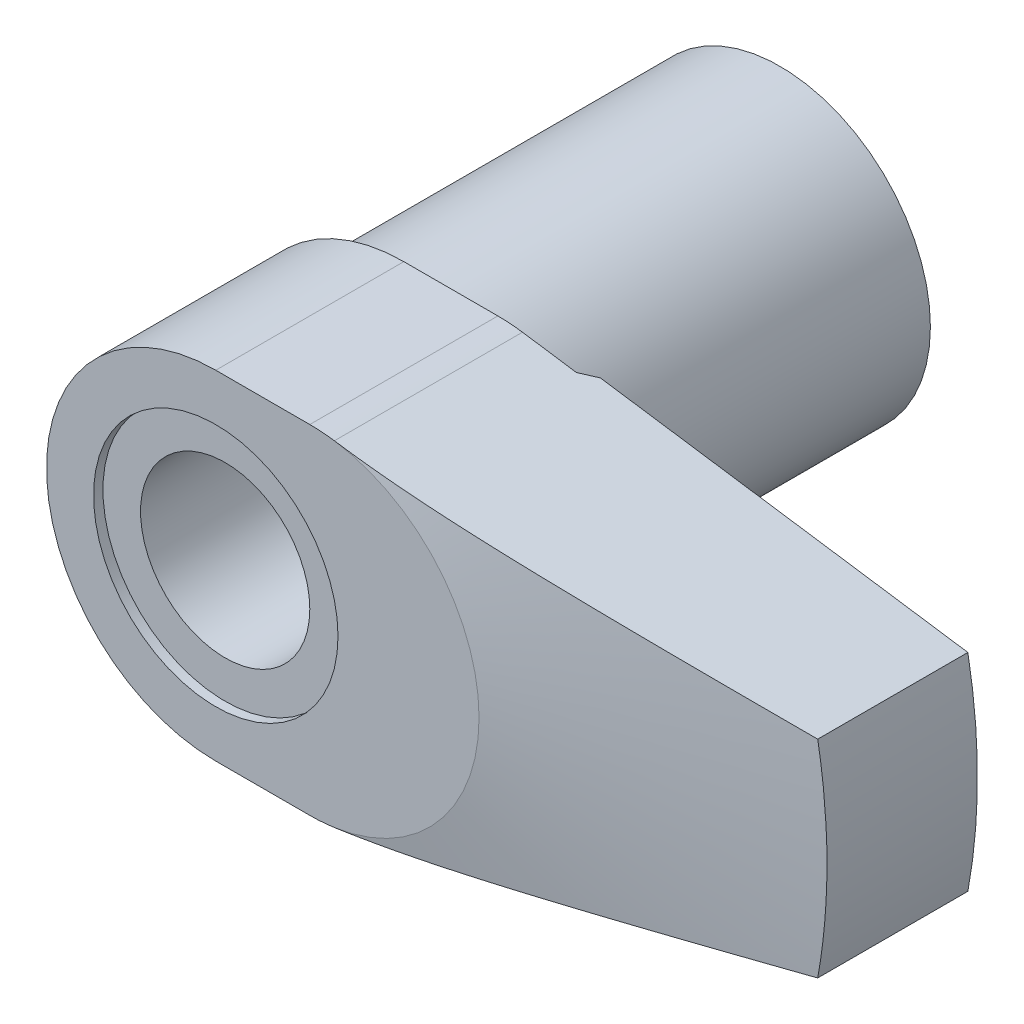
ISO-10303-21;
HEADER;
FILE_DESCRIPTION(('STEP AP214'),'2;1');
FILE_NAME('part.step','',(''),(''),'','','');
FILE_SCHEMA(('AUTOMOTIVE_DESIGN { 1 0 10303 214 1 1 1 1 }'));
ENDSEC;
DATA;
#1=APPLICATION_CONTEXT('core data for automotive mechanical design processes');
#2=APPLICATION_PROTOCOL_DEFINITION('international standard','automotive_design',2000,#1);
#3=PRODUCT_CONTEXT('',#1,'mechanical');
#4=PRODUCT('Part','Part','',(#3));
#5=PRODUCT_RELATED_PRODUCT_CATEGORY('part','',(#4));
#6=PRODUCT_DEFINITION_FORMATION('','',#4);
#7=PRODUCT_DEFINITION_CONTEXT('part definition',#1,'design');
#8=PRODUCT_DEFINITION('design','',#6,#7);
#9=PRODUCT_DEFINITION_SHAPE('','',#8);
#10=(LENGTH_UNIT() NAMED_UNIT(*) SI_UNIT(.MILLI.,.METRE.));
#11=(NAMED_UNIT(*) PLANE_ANGLE_UNIT() SI_UNIT($,.RADIAN.));
#12=(NAMED_UNIT(*) SI_UNIT($,.STERADIAN.) SOLID_ANGLE_UNIT());
#13=UNCERTAINTY_MEASURE_WITH_UNIT(LENGTH_MEASURE(1.E-05),#10,'distance_accuracy_value','');
#14=(GEOMETRIC_REPRESENTATION_CONTEXT(3) GLOBAL_UNCERTAINTY_ASSIGNED_CONTEXT((#13)) GLOBAL_UNIT_ASSIGNED_CONTEXT((#10,
#11,#12)) REPRESENTATION_CONTEXT('',''));
#15=CARTESIAN_POINT('',(0.,0.,0.));
#16=DIRECTION('',(0.,0.,1.));
#17=DIRECTION('',(1.,0.,0.));
#18=AXIS2_PLACEMENT_3D('',#15,#16,#17);
#19=CARTESIAN_POINT('',(-16.,0.,40.));
#20=DIRECTION('',(0.,0.,-1.));
#21=DIRECTION('',(-1.,0.,0.));
#22=AXIS2_PLACEMENT_3D('',#19,#20,#21);
#23=PLANE('',#22);
#24=CARTESIAN_POINT('',(0.,0.,40.));
#25=DIRECTION('',(0.,0.,1.));
#26=DIRECTION('',(1.,0.,0.));
#27=AXIS2_PLACEMENT_3D('',#24,#25,#26);
#28=CIRCLE('',#27,16.);
#29=CARTESIAN_POINT('',(16.,0.,40.));
#30=VERTEX_POINT('',#29);
#31=EDGE_CURVE('E242',#30,#30,#28,.T.);
#32=ORIENTED_EDGE('',*,*,#31,.T.);
#33=EDGE_LOOP('',(#32));
#34=FACE_BOUND('',#33,.T.);
#35=DIRECTION('',(0.989389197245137,-0.145289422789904,0.));
#36=VECTOR('',#35,1.);
#37=CARTESIAN_POINT('',(12.6152096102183,17.8090055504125,40.));
#38=LINE('',#37,#36);
#39=CARTESIAN_POINT('',(12.6152096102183,17.8090055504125,40.));
#40=VERTEX_POINT('',#39);
#41=CARTESIAN_POINT('',(18.362700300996,16.9650003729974,40.));
#42=VERTEX_POINT('',#41);
#43=EDGE_CURVE('E227',#40,#42,#38,.T.);
#44=ORIENTED_EDGE('',*,*,#43,.T.);
#45=CARTESIAN_POINT('',(0.,0.,40.));
#46=DIRECTION('',(0.,0.,1.));
#47=DIRECTION('',(-1.,0.,0.));
#48=AXIS2_PLACEMENT_3D('',#45,#46,#47);
#49=CIRCLE('',#48,25.);
#50=CARTESIAN_POINT('',(18.362700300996,-16.9650003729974,40.));
#51=VERTEX_POINT('',#50);
#52=EDGE_CURVE('E190',#51,#42,#49,.T.);
#53=ORIENTED_EDGE('',*,*,#52,.F.);
#54=DIRECTION('',(-0.989389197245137,-0.145289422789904,0.));
#55=VECTOR('',#54,1.);
#56=CARTESIAN_POINT('',(31.613698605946,-15.0191231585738,40.));
#57=LINE('',#56,#55);
#58=CARTESIAN_POINT('',(12.6152096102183,-17.8090055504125,40.));
#59=VERTEX_POINT('',#58);
#60=EDGE_CURVE('E224',#51,#59,#57,.T.);
#61=ORIENTED_EDGE('',*,*,#60,.T.);
#62=CARTESIAN_POINT('',(10.,0.,40.));
#63=DIRECTION('',(0.,0.,-1.));
#64=DIRECTION('',(-1.,0.,0.));
#65=AXIS2_PLACEMENT_3D('',#62,#63,#64);
#66=CIRCLE('',#65,18.);
#67=CARTESIAN_POINT('',(10.,-18.,40.));
#68=VERTEX_POINT('',#67);
#69=EDGE_CURVE('E229',#59,#68,#66,.T.);
#70=ORIENTED_EDGE('',*,*,#69,.T.);
#71=DIRECTION('',(-1.,0.,0.));
#72=VECTOR('',#71,1.);
#73=CARTESIAN_POINT('',(10.,-18.,40.));
#74=LINE('',#73,#72);
#75=CARTESIAN_POINT('',(0.,-18.,40.));
#76=VERTEX_POINT('',#75);
#77=EDGE_CURVE('E72',#68,#76,#74,.T.);
#78=ORIENTED_EDGE('',*,*,#77,.T.);
#79=CARTESIAN_POINT('',(0.,0.,40.));
#80=DIRECTION('',(0.,0.,1.));
#81=DIRECTION('',(1.,0.,0.));
#82=AXIS2_PLACEMENT_3D('',#79,#80,#81);
#83=CIRCLE('',#82,18.);
#84=CARTESIAN_POINT('',(0.,18.,40.));
#85=VERTEX_POINT('',#84);
#86=EDGE_CURVE('E239',#85,#76,#83,.T.);
#87=ORIENTED_EDGE('',*,*,#86,.F.);
#88=DIRECTION('',(1.,0.,0.));
#89=VECTOR('',#88,1.);
#90=CARTESIAN_POINT('',(0.,18.,40.));
#91=LINE('',#90,#89);
#92=CARTESIAN_POINT('',(10.,18.,40.));
#93=VERTEX_POINT('',#92);
#94=EDGE_CURVE('E236',#85,#93,#91,.T.);
#95=ORIENTED_EDGE('',*,*,#94,.T.);
#96=CARTESIAN_POINT('',(10.,0.,40.));
#97=DIRECTION('',(0.,0.,-1.));
#98=DIRECTION('',(-1.,0.,0.));
#99=AXIS2_PLACEMENT_3D('',#96,#97,#98);
#100=CIRCLE('',#99,18.);
#101=EDGE_CURVE('E232',#93,#40,#100,.T.);
#102=ORIENTED_EDGE('',*,*,#101,.T.);
#103=EDGE_LOOP('',(#44,#53,#61,#70,#78,#87,#95,#102));
#104=FACE_BOUND('',#103,.T.);
#105=ADVANCED_FACE('F14',(#34,#104),#23,.T.);
#106=CARTESIAN_POINT('',(58.9830484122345,-11.,39.));
#107=DIRECTION('',(0.145289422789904,-0.989389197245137,0.));
#108=DIRECTION('',(0.989389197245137,0.145289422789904,0.));
#109=AXIS2_PLACEMENT_3D('',#106,#107,#108);
#110=PLANE('',#109);
#111=CARTESIAN_POINT('',(32.7121770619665,-14.8578142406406,29.071721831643));
#112=CARTESIAN_POINT('',(32.1768504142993,-14.9364256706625,29.5265828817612));
#113=CARTESIAN_POINT('',(31.6398060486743,-15.015289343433,29.9793922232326));
#114=CARTESIAN_POINT('',(30.561720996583,-15.173603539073,30.8801766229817));
#115=CARTESIAN_POINT('',(30.0206801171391,-15.2530540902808,31.3281514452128));
#116=CARTESIAN_POINT('',(28.9334121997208,-15.4127167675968,32.2190494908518));
#117=CARTESIAN_POINT('',(28.387179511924,-15.4929297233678,32.6619656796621));
#118=CARTESIAN_POINT('',(27.2895463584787,-15.6541145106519,33.5411992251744));
#119=CARTESIAN_POINT('',(26.7381459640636,-15.7350863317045,33.9775166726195));
#120=CARTESIAN_POINT('',(25.6094576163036,-15.9008314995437,34.8579288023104));
#121=CARTESIAN_POINT('',(25.0319518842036,-15.9856368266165,35.3017387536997));
#122=CARTESIAN_POINT('',(23.8695212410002,-16.1563369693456,36.1793706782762));
#123=CARTESIAN_POINT('',(23.2845961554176,-16.2422318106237,36.6131924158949));
#124=CARTESIAN_POINT('',(22.1063977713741,-16.4152474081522,37.4685343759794));
#125=CARTESIAN_POINT('',(21.513128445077,-16.5023675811,37.8900601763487));
#126=CARTESIAN_POINT('',(20.316567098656,-16.6780797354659,38.7183158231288));
#127=CARTESIAN_POINT('',(19.7132756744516,-16.7666716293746,39.1250465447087));
#128=CARTESIAN_POINT('',(18.7393341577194,-16.9096925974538,39.7607195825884));
#129=CARTESIAN_POINT('',(18.3724338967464,-16.963571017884,39.995535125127));
#130=CARTESIAN_POINT('',(17.634037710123,-17.0720027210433,40.4576559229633));
#131=CARTESIAN_POINT('',(17.2625419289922,-17.1265559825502,40.6849614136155));
#132=CARTESIAN_POINT('',(16.5144396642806,-17.2364129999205,41.1310358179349));
#133=CARTESIAN_POINT('',(16.1378320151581,-17.291716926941,41.3498027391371));
#134=CARTESIAN_POINT('',(15.3791617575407,-17.4031258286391,41.7774652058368));
#135=CARTESIAN_POINT('',(14.9970991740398,-17.4592307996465,41.986360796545));
#136=CARTESIAN_POINT('',(14.2324631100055,-17.5715157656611,42.3899557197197));
#137=CARTESIAN_POINT('',(13.849971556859,-17.6276837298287,42.5848127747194));
#138=CARTESIAN_POINT('',(13.0789223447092,-17.7409104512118,42.9618096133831));
#139=CARTESIAN_POINT('',(12.6903645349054,-17.7979692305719,43.1439490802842));
#140=CARTESIAN_POINT('',(11.5152496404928,-17.9705320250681,43.6684241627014));
#141=CARTESIAN_POINT('',(10.7188641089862,-18.0874793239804,43.9890248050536));
#142=CARTESIAN_POINT('',(9.33451213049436,-18.2907680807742,44.4722574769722));
#143=CARTESIAN_POINT('',(8.75298355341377,-18.376164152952,44.6537485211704));
#144=CARTESIAN_POINT('',(7.57797857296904,-18.5487108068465,44.9711760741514));
#145=CARTESIAN_POINT('',(6.98450990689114,-18.6358602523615,45.1071411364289));
#146=CARTESIAN_POINT('',(6.08187618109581,-18.7684098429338,45.2731006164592));
#147=CARTESIAN_POINT('',(5.77609718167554,-18.8133127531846,45.3223567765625));
#148=CARTESIAN_POINT('',(5.16261946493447,-18.9034004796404,45.4067127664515));
#149=CARTESIAN_POINT('',(4.8549208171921,-18.948585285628,45.4418131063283));
#150=CARTESIAN_POINT('',(4.23750343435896,-19.0392515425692,45.497363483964));
#151=CARTESIAN_POINT('',(3.92778165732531,-19.0847334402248,45.5177790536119));
#152=CARTESIAN_POINT('',(3.30766991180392,-19.1757953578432,45.5435534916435));
#153=CARTESIAN_POINT('',(2.99727983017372,-19.2213753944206,45.5489095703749));
#154=CARTESIAN_POINT('',(2.68693144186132,-19.2669493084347,45.5465957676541));
#155=B_SPLINE_CURVE_WITH_KNOTS('',3,(#111,#112,#113,#114,#115,#116,#117,#118,#119,#120,#121,
#122,#123,#124,#125,#126,#127,#128,#129,#130,#131,#132,#133,#134,#135,#136,#137,#138,#139,#140,
#141,#142,#143,#144,#145,#146,#147,#148,#149,#150,#151,#152,#153,#154),.UNSPECIFIED.,.F.,.F.,(4,
2,2,2,2,2,2,2,2,2,2,2,2,2,2,2,2,2,2,2,2,4),(0.,2.12059178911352,4.24128665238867,
6.36463930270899,8.48796272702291,10.687657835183,12.8874047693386,15.0861377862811,
17.284740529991,18.6014485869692,19.9181153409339,21.235087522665,22.5520536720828,
23.8505951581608,25.1491689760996,27.7449897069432,29.5890130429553,31.4318776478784,
32.3704819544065,33.309052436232,34.2498188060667,35.1907594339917),.UNSPECIFIED.);
#156=CARTESIAN_POINT('',(19.8939059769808,-16.7401465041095,39.));
#157=VERTEX_POINT('',#156);
#158=EDGE_CURVE('E182',#157,#51,#155,.T.);
#159=ORIENTED_EDGE('',*,*,#158,.F.);
#160=DIRECTION('',(0.989389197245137,0.145289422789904,0.));
#161=VECTOR('',#160,1.);
#162=CARTESIAN_POINT('',(58.9830484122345,-11.,39.));
#163=LINE('',#162,#161);
#164=CARTESIAN_POINT('',(58.9830484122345,-11.,39.));
#165=VERTEX_POINT('',#164);
#166=EDGE_CURVE('E42',#157,#165,#163,.T.);
#167=ORIENTED_EDGE('',*,*,#166,.T.);
#168=DIRECTION('',(0.,0.,-1.));
#169=VECTOR('',#168,1.);
#170=CARTESIAN_POINT('',(58.9830484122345,-11.,60.));
#171=LINE('',#170,#169);
#172=CARTESIAN_POINT('',(58.9830484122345,-11.,54.9682846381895));
#173=VERTEX_POINT('',#172);
#174=EDGE_CURVE('E124',#173,#165,#171,.T.);
#175=ORIENTED_EDGE('',*,*,#174,.F.);
#176=CARTESIAN_POINT('',(58.9832484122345,-10.9999706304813,54.9682551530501));
#177=CARTESIAN_POINT('',(58.0214058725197,-11.1412148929,55.1100465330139));
#178=CARTESIAN_POINT('',(57.0594852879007,-11.2824706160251,55.251299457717));
#179=CARTESIAN_POINT('',(55.1354545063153,-11.5650099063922,55.5324883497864));
#180=CARTESIAN_POINT('',(54.1733443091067,-11.7062934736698,55.6724243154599));
#181=CARTESIAN_POINT('',(52.2489840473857,-11.988881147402,55.9507271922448));
#182=CARTESIAN_POINT('',(51.2867340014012,-12.1301852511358,56.0890942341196));
#183=CARTESIAN_POINT('',(49.3619717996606,-12.4128319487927,56.3639534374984));
#184=CARTESIAN_POINT('',(48.3994596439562,-12.5541745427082,56.5004455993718));
#185=CARTESIAN_POINT('',(46.4750142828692,-12.8367747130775,56.771030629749));
#186=CARTESIAN_POINT('',(45.5130813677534,-12.9780322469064,56.9051256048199));
#187=CARTESIAN_POINT('',(43.5888402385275,-13.2606024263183,57.1705348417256));
#188=CARTESIAN_POINT('',(42.6265320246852,-13.4019150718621,57.3018491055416));
#189=CARTESIAN_POINT('',(40.7013579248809,-13.6846222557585,57.5610504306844));
#190=CARTESIAN_POINT('',(39.7384919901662,-13.8260168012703,57.6889371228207));
#191=CARTESIAN_POINT('',(37.81220765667,-14.1088870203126,57.94040722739));
#192=CARTESIAN_POINT('',(36.8487892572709,-14.2503626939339,58.0639906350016));
#193=CARTESIAN_POINT('',(34.9199051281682,-14.5336146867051,58.3058969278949));
#194=CARTESIAN_POINT('',(33.9544384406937,-14.6753911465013,58.4242120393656));
#195=CARTESIAN_POINT('',(32.0226951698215,-14.9590629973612,58.6539019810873));
#196=CARTESIAN_POINT('',(31.0564185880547,-15.1009583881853,58.7652768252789));
#197=CARTESIAN_POINT('',(29.1231390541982,-15.3848558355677,58.979111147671));
#198=CARTESIAN_POINT('',(28.156136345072,-15.5268578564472,59.0815728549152));
#199=CARTESIAN_POINT('',(26.2209912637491,-15.8110292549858,59.275114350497));
#200=CARTESIAN_POINT('',(25.2528488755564,-15.9531986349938,59.36619397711));
#201=CARTESIAN_POINT('',(23.3142894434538,-16.2378714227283,59.5339788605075));
#202=CARTESIAN_POINT('',(22.3438710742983,-16.3803750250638,59.6106686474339));
#203=CARTESIAN_POINT('',(20.4018241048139,-16.6655599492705,59.7459979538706));
#204=CARTESIAN_POINT('',(19.4301955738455,-16.8082412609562,59.8046384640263));
#205=CARTESIAN_POINT('',(17.9715594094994,-17.0224384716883,59.8764524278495));
#206=CARTESIAN_POINT('',(17.484935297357,-17.0938980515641,59.8977050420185));
#207=CARTESIAN_POINT('',(16.5114734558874,-17.2368485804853,59.9344442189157));
#208=CARTESIAN_POINT('',(16.0246357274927,-17.3083395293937,59.9499308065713));
#209=CARTESIAN_POINT('',(15.0507109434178,-17.4513580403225,59.9748347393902));
#210=CARTESIAN_POINT('',(14.5636238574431,-17.5228856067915,59.9842508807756));
#211=CARTESIAN_POINT('',(13.5893617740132,-17.6659536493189,59.9968451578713));
#212=CARTESIAN_POINT('',(13.1021867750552,-17.737494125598,60.0000231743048));
#213=CARTESIAN_POINT('',(12.6150096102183,-17.8090349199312,59.9999999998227));
#214=B_SPLINE_CURVE_WITH_KNOTS('',3,(#176,#177,#178,#179,#180,#181,#182,#183,#184,#185,#186,
#187,#188,#189,#190,#191,#192,#193,#194,#195,#196,#197,#198,#199,#200,#201,#202,#203,#204,#205,
#206,#207,#208,#209,#210,#211,#212,#213),.UNSPECIFIED.,.F.,.F.,(4,2,2,2,2,2,2,2,2,2,2,2,2,2,2,2,
2,2,4),(0.,2.94733174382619,5.89466727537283,8.84175532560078,11.7888427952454,14.7331987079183,
17.6775525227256,20.6222222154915,23.5668952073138,26.5157783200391,29.4646555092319,
32.4127930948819,35.360972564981,38.3123035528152,41.2634725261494,42.7403498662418,
44.2172208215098,45.6943845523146,47.1715765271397),.UNSPECIFIED.);
#215=CARTESIAN_POINT('',(12.6152096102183,-17.8090055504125,60.));
#216=VERTEX_POINT('',#215);
#217=EDGE_CURVE('E33',#173,#216,#214,.T.);
#218=ORIENTED_EDGE('',*,*,#217,.T.);
#219=DIRECTION('',(0.,0.,1.));
#220=VECTOR('',#219,1.);
#221=CARTESIAN_POINT('',(12.6152096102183,-17.8090055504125,39.));
#222=LINE('',#221,#220);
#223=EDGE_CURVE('E75',#59,#216,#222,.T.);
#224=ORIENTED_EDGE('',*,*,#223,.F.);
#225=ORIENTED_EDGE('',*,*,#60,.F.);
#226=EDGE_LOOP('',(#159,#167,#175,#218,#224,#225));
#227=FACE_BOUND('',#226,.T.);
#228=ADVANCED_FACE('F155',(#227),#110,.T.);
#229=CARTESIAN_POINT('',(58.9830484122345,11.,39.));
#230=DIRECTION('',(0.145289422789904,0.989389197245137,0.));
#231=DIRECTION('',(-0.989389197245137,0.145289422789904,0.));
#232=AXIS2_PLACEMENT_3D('',#229,#230,#231);
#233=PLANE('',#232);
#234=CARTESIAN_POINT('',(2.68693144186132,19.2669493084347,45.5465957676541));
#235=CARTESIAN_POINT('',(2.98145158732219,19.223699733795,45.5487858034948));
#236=CARTESIAN_POINT('',(3.27601082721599,19.1804444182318,45.5440756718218));
#237=CARTESIAN_POINT('',(3.86456646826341,19.0940164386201,45.5210787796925));
#238=CARTESIAN_POINT('',(4.15856294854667,19.0508437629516,45.5027940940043));
#239=CARTESIAN_POINT('',(4.74486318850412,18.9647469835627,45.452921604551));
#240=CARTESIAN_POINT('',(5.03716914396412,18.9218225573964,45.4213601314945));
#241=CARTESIAN_POINT('',(5.62013073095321,18.8362160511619,45.3453947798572));
#242=CARTESIAN_POINT('',(5.91078631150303,18.7935339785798,45.3009905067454));
#243=CARTESIAN_POINT('',(6.76882599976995,18.6675329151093,45.1512224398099));
#244=CARTESIAN_POINT('',(7.33328394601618,18.5846436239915,45.0283225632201));
#245=CARTESIAN_POINT('',(8.451700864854,18.4204067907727,44.7406011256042));
#246=CARTESIAN_POINT('',(9.00565480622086,18.339059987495,44.5757599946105));
#247=CARTESIAN_POINT('',(10.1423179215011,18.1721437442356,44.1966843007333));
#248=CARTESIAN_POINT('',(10.7241221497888,18.0867071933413,43.979697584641));
#249=CARTESIAN_POINT('',(11.874146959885,17.9178288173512,43.5113812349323));
#250=CARTESIAN_POINT('',(12.4423622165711,17.8343877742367,43.260038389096));
#251=CARTESIAN_POINT('',(13.5665418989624,17.6693046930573,42.7288803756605));
#252=CARTESIAN_POINT('',(14.1224869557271,17.5876654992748,42.4490236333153));
#253=CARTESIAN_POINT('',(15.2223159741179,17.4261582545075,41.8663475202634));
#254=CARTESIAN_POINT('',(15.7662012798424,17.3462900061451,41.5635307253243));
#255=CARTESIAN_POINT('',(16.8534042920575,17.186636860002,40.9331890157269));
#256=CARTESIAN_POINT('',(17.3965176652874,17.106881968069,40.6053057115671));
#257=CARTESIAN_POINT('',(18.4729358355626,16.9488125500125,39.9335173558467));
#258=CARTESIAN_POINT('',(19.0062403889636,16.8704980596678,39.5896119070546));
#259=CARTESIAN_POINT('',(20.0638152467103,16.7151957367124,38.888857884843));
#260=CARTESIAN_POINT('',(20.5880925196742,16.638206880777,38.5320200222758));
#261=CARTESIAN_POINT('',(21.6291298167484,16.485333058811,37.8073541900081));
#262=CARTESIAN_POINT('',(22.1458899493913,16.4094480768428,37.4395263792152));
#263=CARTESIAN_POINT('',(23.0989749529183,16.2694898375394,36.7482164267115));
#264=CARTESIAN_POINT('',(23.5361770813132,16.2052877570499,36.4259666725));
#265=CARTESIAN_POINT('',(24.4062909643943,16.0775136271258,35.7755947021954));
#266=CARTESIAN_POINT('',(24.8392026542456,16.013941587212,35.4474723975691));
#267=CARTESIAN_POINT('',(25.7012470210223,15.8873524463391,34.7860686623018));
#268=CARTESIAN_POINT('',(26.130379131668,15.8243354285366,34.4527864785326));
#269=CARTESIAN_POINT('',(26.9852017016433,15.6988067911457,33.7817424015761));
#270=CARTESIAN_POINT('',(27.4108921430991,15.6362951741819,33.4439804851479));
#271=CARTESIAN_POINT('',(28.2466579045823,15.5135649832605,32.7745441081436));
#272=CARTESIAN_POINT('',(28.6568232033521,15.4533331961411,32.442984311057));
#273=CARTESIAN_POINT('',(29.4745229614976,15.3332559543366,31.7765666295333));
#274=CARTESIAN_POINT('',(29.8820574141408,15.2734105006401,31.4417087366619));
#275=CARTESIAN_POINT('',(30.6946035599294,15.1540900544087,30.7691723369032));
#276=CARTESIAN_POINT('',(31.099616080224,15.094614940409,30.43149485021));
#277=CARTESIAN_POINT('',(31.9074698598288,14.9759835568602,29.7535083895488));
#278=CARTESIAN_POINT('',(32.3103111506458,14.9168272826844,29.4131994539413));
#279=CARTESIAN_POINT('',(32.7121770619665,14.8578142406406,29.071721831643));
#280=B_SPLINE_CURVE_WITH_KNOTS('',3,(#234,#235,#236,#237,#238,#239,#240,#241,#242,#243,#244,
#245,#246,#247,#248,#249,#250,#251,#252,#253,#254,#255,#256,#257,#258,#259,#260,#261,#262,#263,
#264,#265,#266,#267,#268,#269,#270,#271,#272,#273,#274,#275,#276,#277,#278,#279),.UNSPECIFIED.,
.F.,.F.,(4,2,2,2,2,2,2,2,2,2,2,2,2,2,2,2,2,2,2,2,2,2,4),(0.,0.89296364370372,1.78579083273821,
2.67685564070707,3.5679478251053,5.31675475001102,7.06637917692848,8.94545546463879,
10.8252564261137,12.7078385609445,14.590209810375,16.5080976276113,18.4260330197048,
20.3424147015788,22.2587686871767,23.899451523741,25.5401591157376,27.1811084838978,
28.82206636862,30.4145797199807,32.0070971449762,33.5990613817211,35.1910024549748),.UNSPECIFIED.);
#281=CARTESIAN_POINT('',(19.8939059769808,16.7401465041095,39.));
#282=VERTEX_POINT('',#281);
#283=EDGE_CURVE('E191',#42,#282,#280,.T.);
#284=ORIENTED_EDGE('',*,*,#283,.F.);
#285=ORIENTED_EDGE('',*,*,#43,.F.);
#286=DIRECTION('',(0.,0.,1.));
#287=VECTOR('',#286,1.);
#288=CARTESIAN_POINT('',(12.6152096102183,17.8090055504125,39.));
#289=LINE('',#288,#287);
#290=CARTESIAN_POINT('',(12.6152096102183,17.8090055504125,60.));
#291=VERTEX_POINT('',#290);
#292=EDGE_CURVE('E105',#40,#291,#289,.T.);
#293=ORIENTED_EDGE('',*,*,#292,.T.);
#294=CARTESIAN_POINT('',(12.6150096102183,17.8090349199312,59.9999999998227));
#295=CARTESIAN_POINT('',(12.9896160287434,17.7540248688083,60.0000068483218));
#296=CARTESIAN_POINT('',(13.3642199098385,17.6990151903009,59.9981340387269));
#297=CARTESIAN_POINT('',(14.1133889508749,17.5890015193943,59.9906818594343));
#298=CARTESIAN_POINT('',(14.4879541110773,17.5339975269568,59.985102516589));
#299=CARTESIAN_POINT('',(15.6114717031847,17.3690116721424,59.9628853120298));
#300=CARTESIAN_POINT('',(16.3603237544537,17.2590445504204,59.9407682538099));
#301=CARTESIAN_POINT('',(17.8570506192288,17.0392538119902,59.8829425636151));
#302=CARTESIAN_POINT('',(18.6049257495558,16.9294301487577,59.8472421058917));
#303=CARTESIAN_POINT('',(20.1000237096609,16.7098786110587,59.7636991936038));
#304=CARTESIAN_POINT('',(20.8472465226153,16.6001507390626,59.7158564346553));
#305=CARTESIAN_POINT('',(22.340269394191,16.3809039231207,59.6097084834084));
#306=CARTESIAN_POINT('',(23.0860701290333,16.2713848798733,59.5514129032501));
#307=CARTESIAN_POINT('',(24.5769445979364,16.052453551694,59.4259383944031));
#308=CARTESIAN_POINT('',(25.322018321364,15.9430412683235,59.3587593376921));
#309=CARTESIAN_POINT('',(26.8115041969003,15.7243138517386,59.2169848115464));
#310=CARTESIAN_POINT('',(27.5559163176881,15.6149987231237,59.142389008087));
#311=CARTESIAN_POINT('',(29.0441142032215,15.3964604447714,58.987051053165));
#312=CARTESIAN_POINT('',(29.787899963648,15.2872372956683,58.9063088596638));
#313=CARTESIAN_POINT('',(31.7194176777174,15.0035985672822,58.6899793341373));
#314=CARTESIAN_POINT('',(32.9067179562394,14.8292463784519,58.5504618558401));
#315=CARTESIAN_POINT('',(35.2801844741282,14.4807085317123,58.2619120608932));
#316=CARTESIAN_POINT('',(36.4663507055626,14.3065228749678,58.1128796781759));
#317=CARTESIAN_POINT('',(38.244899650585,14.0453472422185,57.8839917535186));
#318=CARTESIAN_POINT('',(38.8376208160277,13.9583075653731,57.8068074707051));
#319=CARTESIAN_POINT('',(40.0228601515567,13.7842580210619,57.6508834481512));
#320=CARTESIAN_POINT('',(40.6153783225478,13.6972481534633,57.572143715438));
#321=CARTESIAN_POINT('',(42.3926784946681,13.4362559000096,57.3339000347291));
#322=CARTESIAN_POINT('',(43.5771950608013,13.262312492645,57.1723730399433));
#323=CARTESIAN_POINT('',(45.9474791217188,12.9142419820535,56.8449320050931));
#324=CARTESIAN_POINT('',(47.1332457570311,12.740115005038,56.6790116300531));
#325=CARTESIAN_POINT('',(49.5043268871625,12.3919274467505,56.3439273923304));
#326=CARTESIAN_POINT('',(50.6896413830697,12.2178668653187,56.1747635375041));
#327=CARTESIAN_POINT('',(53.0598393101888,11.8698090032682,55.8338834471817));
#328=CARTESIAN_POINT('',(54.244722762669,11.6958117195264,55.6621673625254));
#329=CARTESIAN_POINT('',(56.6141924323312,11.347860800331,55.3166529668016));
#330=CARTESIAN_POINT('',(57.7987786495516,11.1739071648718,55.1428546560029));
#331=CARTESIAN_POINT('',(58.9832484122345,10.9999706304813,54.9682551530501));
#332=B_SPLINE_CURVE_WITH_KNOTS('',3,(#294,#295,#296,#297,#298,#299,#300,#301,#302,#303,#304,
#305,#306,#307,#308,#309,#310,#311,#312,#313,#314,#315,#316,#317,#318,#319,#320,#321,#322,#323,
#324,#325,#326,#327,#328,#329,#330,#331),.UNSPECIFIED.,.F.,.F.,(4,2,2,2,2,2,2,2,2,2,2,2,2,2,2,2,
2,2,4),(0.,1.13586220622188,2.27171618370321,4.54318916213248,6.81329736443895,9.08346247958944,
11.3515506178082,13.6196714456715,15.887894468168,18.1561330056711,21.7804255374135,
25.4047432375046,27.2168302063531,29.0289089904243,32.6531004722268,36.2828378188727,
39.9125663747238,43.542081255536,47.1715956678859),.UNSPECIFIED.);
#333=CARTESIAN_POINT('',(58.9830484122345,11.,54.9682846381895));
#334=VERTEX_POINT('',#333);
#335=EDGE_CURVE('E258',#291,#334,#332,.T.);
#336=ORIENTED_EDGE('',*,*,#335,.T.);
#337=DIRECTION('',(0.,0.,-1.));
#338=VECTOR('',#337,1.);
#339=CARTESIAN_POINT('',(58.9830484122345,11.,60.));
#340=LINE('',#339,#338);
#341=CARTESIAN_POINT('',(58.9830484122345,11.,39.));
#342=VERTEX_POINT('',#341);
#343=EDGE_CURVE('E27',#334,#342,#340,.T.);
#344=ORIENTED_EDGE('',*,*,#343,.T.);
#345=DIRECTION('',(-0.989389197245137,0.145289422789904,0.));
#346=VECTOR('',#345,1.);
#347=CARTESIAN_POINT('',(58.9830484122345,11.,39.));
#348=LINE('',#347,#346);
#349=EDGE_CURVE('E86',#342,#282,#348,.T.);
#350=ORIENTED_EDGE('',*,*,#349,.T.);
#351=EDGE_LOOP('',(#284,#285,#293,#336,#344,#350));
#352=FACE_BOUND('',#351,.T.);
#353=ADVANCED_FACE('F147',(#352),#233,.T.);
#354=CARTESIAN_POINT('',(0.,0.,60.));
#355=DIRECTION('',(0.,0.,1.));
#356=DIRECTION('',(1.,0.,0.));
#357=AXIS2_PLACEMENT_3D('',#354,#355,#356);
#358=PLANE('',#357);
#359=CARTESIAN_POINT('',(0.,0.,60.));
#360=DIRECTION('',(0.,0.,1.));
#361=DIRECTION('',(1.,0.,0.));
#362=AXIS2_PLACEMENT_3D('',#359,#360,#361);
#363=CIRCLE('',#362,13.);
#364=CARTESIAN_POINT('',(13.,0.,60.));
#365=VERTEX_POINT('',#364);
#366=EDGE_CURVE('E98',#365,#365,#363,.T.);
#367=ORIENTED_EDGE('',*,*,#366,.F.);
#368=EDGE_LOOP('',(#367));
#369=FACE_BOUND('',#368,.T.);
#370=CARTESIAN_POINT('',(10.,0.,60.));
#371=DIRECTION('',(0.,0.,1.));
#372=DIRECTION('',(1.,0.,0.));
#373=AXIS2_PLACEMENT_3D('',#370,#371,#372);
#374=CIRCLE('',#373,18.);
#375=CARTESIAN_POINT('',(10.,-18.,60.));
#376=VERTEX_POINT('',#375);
#377=EDGE_CURVE('E80',#376,#216,#374,.T.);
#378=ORIENTED_EDGE('',*,*,#377,.T.);
#379=CARTESIAN_POINT('',(10.,0.,60.));
#380=DIRECTION('',(0.,0.,-1.));
#381=DIRECTION('',(-1.,0.,0.));
#382=AXIS2_PLACEMENT_3D('',#379,#380,#381);
#383=CIRCLE('',#382,18.);
#384=EDGE_CURVE('E228',#291,#216,#383,.T.);
#385=ORIENTED_EDGE('',*,*,#384,.F.);
#386=CARTESIAN_POINT('',(10.,0.,60.));
#387=DIRECTION('',(0.,0.,1.));
#388=DIRECTION('',(1.,0.,0.));
#389=AXIS2_PLACEMENT_3D('',#386,#387,#388);
#390=CIRCLE('',#389,18.);
#391=CARTESIAN_POINT('',(10.,18.,60.));
#392=VERTEX_POINT('',#391);
#393=EDGE_CURVE('E94',#291,#392,#390,.T.);
#394=ORIENTED_EDGE('',*,*,#393,.T.);
#395=DIRECTION('',(-1.,0.,0.));
#396=VECTOR('',#395,1.);
#397=CARTESIAN_POINT('',(10.,18.,60.));
#398=LINE('',#397,#396);
#399=CARTESIAN_POINT('',(0.,18.,60.));
#400=VERTEX_POINT('',#399);
#401=EDGE_CURVE('E92',#392,#400,#398,.T.);
#402=ORIENTED_EDGE('',*,*,#401,.T.);
#403=CARTESIAN_POINT('',(0.,0.,60.));
#404=DIRECTION('',(0.,0.,1.));
#405=DIRECTION('',(1.,0.,0.));
#406=AXIS2_PLACEMENT_3D('',#403,#404,#405);
#407=CIRCLE('',#406,18.);
#408=CARTESIAN_POINT('',(1.88540101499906E-13,-18.,60.));
#409=VERTEX_POINT('',#408);
#410=EDGE_CURVE('E91',#400,#409,#407,.T.);
#411=ORIENTED_EDGE('',*,*,#410,.T.);
#412=DIRECTION('',(1.,0.,0.));
#413=VECTOR('',#412,1.);
#414=CARTESIAN_POINT('',(1.88540101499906E-13,-18.,60.));
#415=LINE('',#414,#413);
#416=EDGE_CURVE('E68',#409,#376,#415,.T.);
#417=ORIENTED_EDGE('',*,*,#416,.T.);
#418=EDGE_LOOP('',(#378,#385,#394,#402,#411,#417));
#419=FACE_BOUND('',#418,.T.);
#420=ADVANCED_FACE('F88',(#369,#419),#358,.T.);
#421=CARTESIAN_POINT('',(0.,0.,60.));
#422=DIRECTION('',(0.,0.,-1.));
#423=DIRECTION('',(-1.,0.,0.));
#424=AXIS2_PLACEMENT_3D('',#421,#422,#423);
#425=CYLINDRICAL_SURFACE('',#424,60.);
#426=CARTESIAN_POINT('',(58.9830111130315,-11.0002,54.9682834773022));
#427=CARTESIAN_POINT('',(59.1527597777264,-10.090099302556,54.9735670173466));
#428=CARTESIAN_POINT('',(59.3014127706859,-9.17606069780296,54.9781986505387));
#429=CARTESIAN_POINT('',(59.5562787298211,-7.3420860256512,54.9861448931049));
#430=CARTESIAN_POINT('',(59.6624919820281,-6.42214999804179,54.9894595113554));
#431=CARTESIAN_POINT('',(59.8315167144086,-4.58611708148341,54.9947362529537));
#432=CARTESIAN_POINT('',(59.89468647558,-3.67005319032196,54.9967095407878));
#433=CARTESIAN_POINT('',(59.978928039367,-1.83599286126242,54.9993414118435));
#434=CARTESIAN_POINT('',(60.,-0.91799643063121,55.));
#435=CARTESIAN_POINT('',(60.,0.91799643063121,55.));
#436=CARTESIAN_POINT('',(59.978928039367,1.83599286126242,54.9993414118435));
#437=CARTESIAN_POINT('',(59.89468647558,3.67005319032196,54.9967095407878));
#438=CARTESIAN_POINT('',(59.8315167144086,4.58611708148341,54.9947362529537));
#439=CARTESIAN_POINT('',(59.6624919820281,6.4221499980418,54.9894595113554));
#440=CARTESIAN_POINT('',(59.5562787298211,7.3420860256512,54.9861448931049));
#441=CARTESIAN_POINT('',(59.3014127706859,9.17606069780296,54.9781986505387));
#442=CARTESIAN_POINT('',(59.1527597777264,10.090099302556,54.9735670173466));
#443=CARTESIAN_POINT('',(58.9830111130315,11.0002,54.9682834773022));
#444=B_SPLINE_CURVE_WITH_KNOTS('',3,(#426,#427,#428,#429,#430,#431,#432,#433,#434,#435,#436,
#437,#438,#439,#440,#441,#442,#443),.UNSPECIFIED.,.F.,.F.,(4,2,2,2,2,2,2,2,4),(0.,
2.77718454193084,5.55435036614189,8.30810787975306,11.0618550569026,13.8156022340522,
16.5693597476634,19.3465255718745,22.1237101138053),.UNSPECIFIED.);
#445=EDGE_CURVE('E9',#173,#334,#444,.T.);
#446=ORIENTED_EDGE('',*,*,#445,.F.);
#447=ORIENTED_EDGE('',*,*,#174,.T.);
#448=CARTESIAN_POINT('',(0.,0.,39.));
#449=DIRECTION('',(0.,0.,1.));
#450=DIRECTION('',(1.,0.,0.));
#451=AXIS2_PLACEMENT_3D('',#448,#449,#450);
#452=CIRCLE('',#451,60.);
#453=EDGE_CURVE('E117',#165,#342,#452,.T.);
#454=ORIENTED_EDGE('',*,*,#453,.T.);
#455=ORIENTED_EDGE('',*,*,#343,.F.);
#456=EDGE_LOOP('',(#446,#447,#454,#455));
#457=FACE_BOUND('',#456,.T.);
#458=ADVANCED_FACE('F146',(#457),#425,.T.);
#459=CARTESIAN_POINT('',(10.,0.,39.));
#460=DIRECTION('',(0.,0.,1.));
#461=DIRECTION('',(1.,0.,0.));
#462=AXIS2_PLACEMENT_3D('',#459,#460,#461);
#463=CYLINDRICAL_SURFACE('',#462,18.);
#464=DIRECTION('',(0.,0.,1.));
#465=VECTOR('',#464,1.);
#466=CARTESIAN_POINT('',(10.,-18.,39.));
#467=LINE('',#466,#465);
#468=EDGE_CURVE('E63',#68,#376,#467,.T.);
#469=ORIENTED_EDGE('',*,*,#468,.F.);
#470=ORIENTED_EDGE('',*,*,#69,.F.);
#471=ORIENTED_EDGE('',*,*,#223,.T.);
#472=ORIENTED_EDGE('',*,*,#377,.F.);
#473=EDGE_LOOP('',(#469,#470,#471,#472));
#474=FACE_BOUND('',#473,.T.);
#475=ADVANCED_FACE('F81',(#474),#463,.T.);
#476=CARTESIAN_POINT('',(1.88540101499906E-13,-18.,39.));
#477=DIRECTION('',(0.,-1.,0.));
#478=DIRECTION('',(1.,0.,0.));
#479=AXIS2_PLACEMENT_3D('',#476,#477,#478);
#480=PLANE('',#479);
#481=DIRECTION('',(0.,0.,1.));
#482=VECTOR('',#481,1.);
#483=CARTESIAN_POINT('',(1.88540101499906E-13,-18.,39.));
#484=LINE('',#483,#482);
#485=EDGE_CURVE('E76',#76,#409,#484,.T.);
#486=ORIENTED_EDGE('',*,*,#485,.F.);
#487=ORIENTED_EDGE('',*,*,#77,.F.);
#488=ORIENTED_EDGE('',*,*,#468,.T.);
#489=ORIENTED_EDGE('',*,*,#416,.F.);
#490=EDGE_LOOP('',(#486,#487,#488,#489));
#491=FACE_BOUND('',#490,.T.);
#492=ADVANCED_FACE('F66',(#491),#480,.T.);
#493=CARTESIAN_POINT('',(10.,18.,39.));
#494=DIRECTION('',(0.,1.,0.));
#495=DIRECTION('',(-1.,0.,0.));
#496=AXIS2_PLACEMENT_3D('',#493,#494,#495);
#497=PLANE('',#496);
#498=DIRECTION('',(0.,0.,1.));
#499=VECTOR('',#498,1.);
#500=CARTESIAN_POINT('',(10.,18.,39.));
#501=LINE('',#500,#499);
#502=EDGE_CURVE('E103',#93,#392,#501,.T.);
#503=ORIENTED_EDGE('',*,*,#502,.F.);
#504=ORIENTED_EDGE('',*,*,#94,.F.);
#505=DIRECTION('',(0.,0.,1.));
#506=VECTOR('',#505,1.);
#507=CARTESIAN_POINT('',(0.,18.,39.));
#508=LINE('',#507,#506);
#509=EDGE_CURVE('E101',#85,#400,#508,.T.);
#510=ORIENTED_EDGE('',*,*,#509,.T.);
#511=ORIENTED_EDGE('',*,*,#401,.F.);
#512=EDGE_LOOP('',(#503,#504,#510,#511));
#513=FACE_BOUND('',#512,.T.);
#514=ADVANCED_FACE('F274',(#513),#497,.T.);
#515=CARTESIAN_POINT('',(10.,0.,39.));
#516=DIRECTION('',(0.,0.,1.));
#517=DIRECTION('',(1.,0.,0.));
#518=AXIS2_PLACEMENT_3D('',#515,#516,#517);
#519=CYLINDRICAL_SURFACE('',#518,18.);
#520=ORIENTED_EDGE('',*,*,#292,.F.);
#521=ORIENTED_EDGE('',*,*,#101,.F.);
#522=ORIENTED_EDGE('',*,*,#502,.T.);
#523=ORIENTED_EDGE('',*,*,#393,.F.);
#524=EDGE_LOOP('',(#520,#521,#522,#523));
#525=FACE_BOUND('',#524,.T.);
#526=ADVANCED_FACE('F251',(#525),#519,.T.);
#527=CARTESIAN_POINT('',(0.,0.,60.));
#528=DIRECTION('',(0.,0.,-1.));
#529=DIRECTION('',(-1.,0.,0.));
#530=AXIS2_PLACEMENT_3D('',#527,#528,#529);
#531=CYLINDRICAL_SURFACE('',#530,18.);
#532=ORIENTED_EDGE('',*,*,#86,.T.);
#533=ORIENTED_EDGE('',*,*,#485,.T.);
#534=ORIENTED_EDGE('',*,*,#410,.F.);
#535=ORIENTED_EDGE('',*,*,#509,.F.);
#536=EDGE_LOOP('',(#532,#533,#534,#535));
#537=FACE_BOUND('',#536,.T.);
#538=ADVANCED_FACE('F16',(#537),#531,.T.);
#539=CARTESIAN_POINT('',(70.,20.,39.));
#540=DIRECTION('',(0.,0.,1.));
#541=DIRECTION('',(1.,0.,0.));
#542=AXIS2_PLACEMENT_3D('',#539,#540,#541);
#543=PLANE('',#542);
#544=ORIENTED_EDGE('',*,*,#166,.F.);
#545=CARTESIAN_POINT('',(0.,0.,39.));
#546=DIRECTION('',(0.,0.,1.));
#547=DIRECTION('',(1.,0.,0.));
#548=AXIS2_PLACEMENT_3D('',#545,#546,#547);
#549=CIRCLE('',#548,26.);
#550=EDGE_CURVE('E215',#157,#282,#549,.T.);
#551=ORIENTED_EDGE('',*,*,#550,.T.);
#552=ORIENTED_EDGE('',*,*,#349,.F.);
#553=ORIENTED_EDGE('',*,*,#453,.F.);
#554=EDGE_LOOP('',(#544,#551,#552,#553));
#555=FACE_BOUND('',#554,.T.);
#556=ADVANCED_FACE('F277',(#555),#543,.F.);
#557=CARTESIAN_POINT('',(0.,0.,60.));
#558=DIRECTION('',(0.,0.,-1.));
#559=DIRECTION('',(-1.,0.,0.));
#560=AXIS2_PLACEMENT_3D('',#557,#558,#559);
#561=CYLINDRICAL_SURFACE('',#560,9.);
#562=CARTESIAN_POINT('',(0.,0.,0.));
#563=DIRECTION('',(0.,0.,1.));
#564=DIRECTION('',(1.,0.,0.));
#565=AXIS2_PLACEMENT_3D('',#562,#563,#564);
#566=CIRCLE('',#565,9.);
#567=CARTESIAN_POINT('',(9.,0.,0.));
#568=VERTEX_POINT('',#567);
#569=EDGE_CURVE('E120',#568,#568,#566,.T.);
#570=ORIENTED_EDGE('',*,*,#569,.F.);
#571=EDGE_LOOP('',(#570));
#572=FACE_BOUND('',#571,.T.);
#573=CARTESIAN_POINT('',(0.,0.,59.));
#574=DIRECTION('',(0.,0.,1.));
#575=DIRECTION('',(1.,0.,0.));
#576=AXIS2_PLACEMENT_3D('',#573,#574,#575);
#577=CIRCLE('',#576,9.);
#578=CARTESIAN_POINT('',(9.,0.,59.));
#579=VERTEX_POINT('',#578);
#580=EDGE_CURVE('E111',#579,#579,#577,.T.);
#581=ORIENTED_EDGE('',*,*,#580,.T.);
#582=EDGE_LOOP('',(#581));
#583=FACE_BOUND('',#582,.T.);
#584=ADVANCED_FACE('F129',(#572,#583),#561,.F.);
#585=CARTESIAN_POINT('',(0.,0.,0.));
#586=DIRECTION('',(0.,0.,1.));
#587=DIRECTION('',(1.,0.,0.));
#588=AXIS2_PLACEMENT_3D('',#585,#586,#587);
#589=PLANE('',#588);
#590=ORIENTED_EDGE('',*,*,#569,.T.);
#591=EDGE_LOOP('',(#590));
#592=FACE_BOUND('',#591,.T.);
#593=CARTESIAN_POINT('',(0.,0.,0.));
#594=DIRECTION('',(0.,0.,-1.));
#595=DIRECTION('',(-1.,0.,0.));
#596=AXIS2_PLACEMENT_3D('',#593,#594,#595);
#597=CIRCLE('',#596,16.);
#598=CARTESIAN_POINT('',(-16.,0.,0.));
#599=VERTEX_POINT('',#598);
#600=EDGE_CURVE('E114',#599,#599,#597,.T.);
#601=ORIENTED_EDGE('',*,*,#600,.T.);
#602=EDGE_LOOP('',(#601));
#603=FACE_BOUND('',#602,.T.);
#604=ADVANCED_FACE('F302',(#592,#603),#589,.F.);
#605=CARTESIAN_POINT('',(0.,0.,39.));
#606=DIRECTION('',(0.,0.,-1.));
#607=DIRECTION('',(-1.,0.,0.));
#608=AXIS2_PLACEMENT_3D('',#605,#606,#607);
#609=CYLINDRICAL_SURFACE('',#608,16.);
#610=ORIENTED_EDGE('',*,*,#600,.F.);
#611=EDGE_LOOP('',(#610));
#612=FACE_BOUND('',#611,.T.);
#613=ORIENTED_EDGE('',*,*,#31,.F.);
#614=EDGE_LOOP('',(#613));
#615=FACE_BOUND('',#614,.T.);
#616=ADVANCED_FACE('F141',(#612,#615),#609,.T.);
#617=CARTESIAN_POINT('',(0.,0.,59.));
#618=DIRECTION('',(0.,0.,1.));
#619=DIRECTION('',(1.,0.,0.));
#620=AXIS2_PLACEMENT_3D('',#617,#618,#619);
#621=CYLINDRICAL_SURFACE('',#620,13.);
#622=CARTESIAN_POINT('',(0.,0.,59.));
#623=DIRECTION('',(0.,0.,1.));
#624=DIRECTION('',(1.,0.,0.));
#625=AXIS2_PLACEMENT_3D('',#622,#623,#624);
#626=CIRCLE('',#625,13.);
#627=CARTESIAN_POINT('',(13.,0.,59.));
#628=VERTEX_POINT('',#627);
#629=EDGE_CURVE('E108',#628,#628,#626,.T.);
#630=ORIENTED_EDGE('',*,*,#629,.F.);
#631=EDGE_LOOP('',(#630));
#632=FACE_BOUND('',#631,.T.);
#633=ORIENTED_EDGE('',*,*,#366,.T.);
#634=EDGE_LOOP('',(#633));
#635=FACE_BOUND('',#634,.T.);
#636=ADVANCED_FACE('F135',(#632,#635),#621,.F.);
#637=CARTESIAN_POINT('',(0.,0.,59.));
#638=DIRECTION('',(0.,0.,1.));
#639=DIRECTION('',(1.,0.,0.));
#640=AXIS2_PLACEMENT_3D('',#637,#638,#639);
#641=PLANE('',#640);
#642=ORIENTED_EDGE('',*,*,#580,.F.);
#643=EDGE_LOOP('',(#642));
#644=FACE_BOUND('',#643,.T.);
#645=ORIENTED_EDGE('',*,*,#629,.T.);
#646=EDGE_LOOP('',(#645));
#647=FACE_BOUND('',#646,.T.);
#648=ADVANCED_FACE('F131',(#644,#647),#641,.T.);
#649=CARTESIAN_POINT('',(10.,0.,53.8108003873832));
#650=DIRECTION('',(0.,0.,-1.));
#651=DIRECTION('',(-1.,0.,0.));
#652=AXIS2_PLACEMENT_3D('',#649,#650,#651);
#653=CONICAL_SURFACE('',#652,57.6108775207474,1.41579958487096);
#654=ORIENTED_EDGE('',*,*,#445,.T.);
#655=ORIENTED_EDGE('',*,*,#335,.F.);
#656=ORIENTED_EDGE('',*,*,#384,.T.);
#657=ORIENTED_EDGE('',*,*,#217,.F.);
#658=EDGE_LOOP('',(#654,#655,#656,#657));
#659=FACE_BOUND('',#658,.T.);
#660=ADVANCED_FACE('F134',(#659),#653,.T.);
#661=CARTESIAN_POINT('',(0.,0.,40.));
#662=DIRECTION('',(0.,0.,-1.));
#663=DIRECTION('',(-1.,0.,0.));
#664=AXIS2_PLACEMENT_3D('',#661,#662,#663);
#665=CONICAL_SURFACE('',#664,25.,0.785398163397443);
#666=ORIENTED_EDGE('',*,*,#158,.T.);
#667=ORIENTED_EDGE('',*,*,#52,.T.);
#668=ORIENTED_EDGE('',*,*,#283,.T.);
#669=ORIENTED_EDGE('',*,*,#550,.F.);
#670=EDGE_LOOP('',(#666,#667,#668,#669));
#671=FACE_BOUND('',#670,.T.);
#672=ADVANCED_FACE('F198',(#671),#665,.F.);
#673=CLOSED_SHELL('',(#105,#228,#353,#420,#458,#475,#492,#514,#526,#538,#556,#584,#604,#616,
#636,#648,#660,#672));
#674=MANIFOLD_SOLID_BREP('B1',#673);
#675=ADVANCED_BREP_SHAPE_REPRESENTATION('',(#18,#674),#14);
#676=SHAPE_DEFINITION_REPRESENTATION(#9,#675);
ENDSEC;
END-ISO-10303-21;
